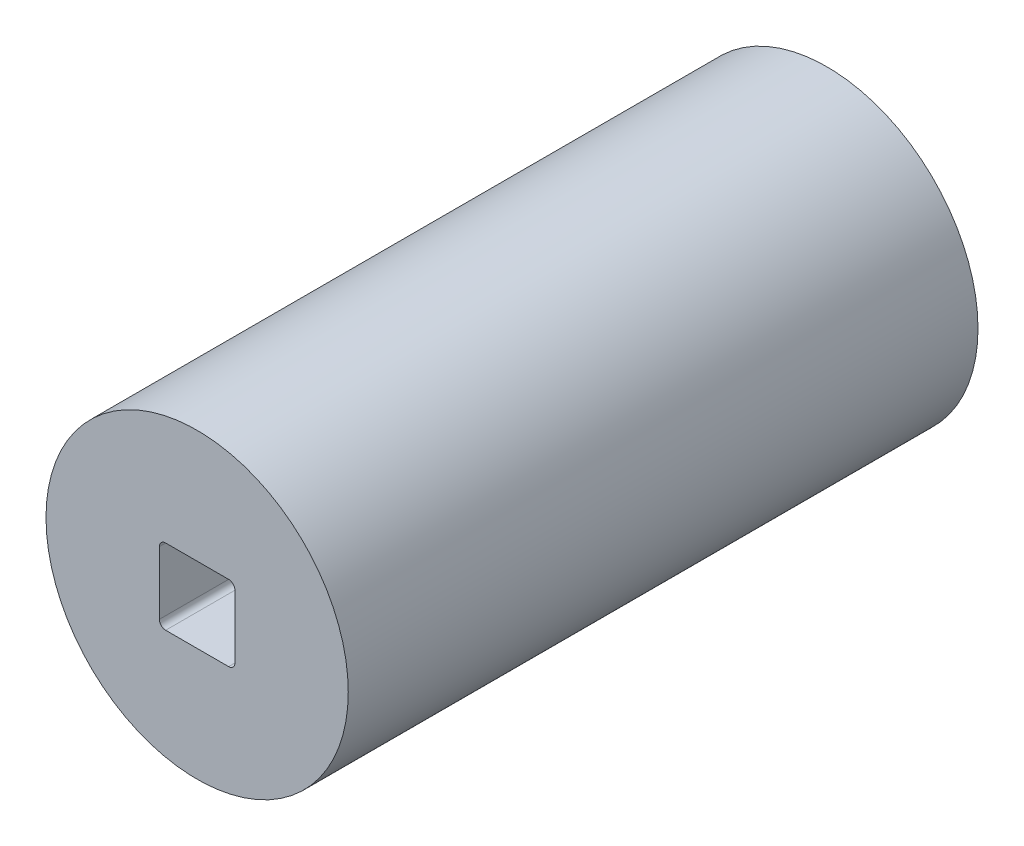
ISO-10303-21;
HEADER;
FILE_DESCRIPTION(('STEP AP214'),'2;1');
FILE_NAME('part.step','',(''),(''),'','','');
FILE_SCHEMA(('AUTOMOTIVE_DESIGN { 1 0 10303 214 1 1 1 1 }'));
ENDSEC;
DATA;
#1=APPLICATION_CONTEXT('core data for automotive mechanical design processes');
#2=APPLICATION_PROTOCOL_DEFINITION('international standard','automotive_design',2000,#1);
#3=PRODUCT_CONTEXT('',#1,'mechanical');
#4=PRODUCT('Part','Part','',(#3));
#5=PRODUCT_RELATED_PRODUCT_CATEGORY('part','',(#4));
#6=PRODUCT_DEFINITION_FORMATION('','',#4);
#7=PRODUCT_DEFINITION_CONTEXT('part definition',#1,'design');
#8=PRODUCT_DEFINITION('design','',#6,#7);
#9=PRODUCT_DEFINITION_SHAPE('','',#8);
#10=(LENGTH_UNIT() NAMED_UNIT(*) SI_UNIT(.MILLI.,.METRE.));
#11=(NAMED_UNIT(*) PLANE_ANGLE_UNIT() SI_UNIT($,.RADIAN.));
#12=(NAMED_UNIT(*) SI_UNIT($,.STERADIAN.) SOLID_ANGLE_UNIT());
#13=UNCERTAINTY_MEASURE_WITH_UNIT(LENGTH_MEASURE(1.E-05),#10,'distance_accuracy_value','');
#14=(GEOMETRIC_REPRESENTATION_CONTEXT(3) GLOBAL_UNCERTAINTY_ASSIGNED_CONTEXT((#13)) GLOBAL_UNIT_ASSIGNED_CONTEXT((#10,
#11,#12)) REPRESENTATION_CONTEXT('',''));
#15=CARTESIAN_POINT('',(0.,0.,0.));
#16=DIRECTION('',(0.,0.,1.));
#17=DIRECTION('',(1.,0.,0.));
#18=AXIS2_PLACEMENT_3D('',#15,#16,#17);
#19=CARTESIAN_POINT('',(0.,0.,-1270.));
#20=DIRECTION('',(0.,0.,1.));
#21=DIRECTION('',(1.,0.,0.));
#22=AXIS2_PLACEMENT_3D('',#19,#20,#21);
#23=CYLINDRICAL_SURFACE('',#22,304.8);
#24=CARTESIAN_POINT('',(0.,0.,-1270.));
#25=DIRECTION('',(0.,0.,1.));
#26=DIRECTION('',(1.,0.,0.));
#27=AXIS2_PLACEMENT_3D('',#24,#25,#26);
#28=CIRCLE('',#27,304.8);
#29=CARTESIAN_POINT('',(304.8,0.,-1270.));
#30=VERTEX_POINT('',#29);
#31=EDGE_CURVE('E55',#30,#30,#28,.T.);
#32=CARTESIAN_POINT('',(0.,0.,0.));
#33=DIRECTION('',(0.,0.,1.));
#34=DIRECTION('',(1.,0.,0.));
#35=AXIS2_PLACEMENT_3D('',#32,#33,#34);
#36=CIRCLE('',#35,304.8);
#37=CARTESIAN_POINT('',(304.8,0.,0.));
#38=VERTEX_POINT('',#37);
#39=EDGE_CURVE('E243',#38,#38,#36,.T.);
#40=CARTESIAN_POINT('',(304.8,0.,-1270.));
#41=CARTESIAN_POINT('',(304.8,0.,-1256.77083333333));
#42=CARTESIAN_POINT('',(304.8,0.,-1243.54166666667));
#43=CARTESIAN_POINT('',(304.8,0.,-1217.08333333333));
#44=CARTESIAN_POINT('',(304.8,0.,-1203.85416666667));
#45=CARTESIAN_POINT('',(304.8,0.,-1177.39583333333));
#46=CARTESIAN_POINT('',(304.8,0.,-1164.16666666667));
#47=CARTESIAN_POINT('',(304.8,0.,-1137.70833333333));
#48=CARTESIAN_POINT('',(304.8,0.,-1124.47916666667));
#49=CARTESIAN_POINT('',(304.8,0.,-1098.02083333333));
#50=CARTESIAN_POINT('',(304.8,0.,-1084.79166666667));
#51=CARTESIAN_POINT('',(304.8,0.,-1058.33333333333));
#52=CARTESIAN_POINT('',(304.8,0.,-1045.10416666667));
#53=CARTESIAN_POINT('',(304.8,0.,-1018.64583333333));
#54=CARTESIAN_POINT('',(304.8,0.,-1005.41666666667));
#55=CARTESIAN_POINT('',(304.8,0.,-978.958333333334));
#56=CARTESIAN_POINT('',(304.8,0.,-965.729166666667));
#57=CARTESIAN_POINT('',(304.8,0.,-939.270833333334));
#58=CARTESIAN_POINT('',(304.8,0.,-926.041666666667));
#59=CARTESIAN_POINT('',(304.8,0.,-899.583333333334));
#60=CARTESIAN_POINT('',(304.8,0.,-886.354166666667));
#61=CARTESIAN_POINT('',(304.8,0.,-859.895833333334));
#62=CARTESIAN_POINT('',(304.8,0.,-846.666666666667));
#63=CARTESIAN_POINT('',(304.8,0.,-820.208333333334));
#64=CARTESIAN_POINT('',(304.8,0.,-806.979166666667));
#65=CARTESIAN_POINT('',(304.8,0.,-780.520833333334));
#66=CARTESIAN_POINT('',(304.8,0.,-767.291666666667));
#67=CARTESIAN_POINT('',(304.8,0.,-740.833333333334));
#68=CARTESIAN_POINT('',(304.8,0.,-727.604166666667));
#69=CARTESIAN_POINT('',(304.8,0.,-701.145833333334));
#70=CARTESIAN_POINT('',(304.8,0.,-687.916666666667));
#71=CARTESIAN_POINT('',(304.8,0.,-661.458333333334));
#72=CARTESIAN_POINT('',(304.8,0.,-648.229166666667));
#73=CARTESIAN_POINT('',(304.8,0.,-621.770833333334));
#74=CARTESIAN_POINT('',(304.8,0.,-608.541666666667));
#75=CARTESIAN_POINT('',(304.8,0.,-582.083333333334));
#76=CARTESIAN_POINT('',(304.8,0.,-568.854166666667));
#77=CARTESIAN_POINT('',(304.8,0.,-542.395833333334));
#78=CARTESIAN_POINT('',(304.8,0.,-529.166666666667));
#79=CARTESIAN_POINT('',(304.8,0.,-502.708333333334));
#80=CARTESIAN_POINT('',(304.8,0.,-489.479166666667));
#81=CARTESIAN_POINT('',(304.8,0.,-463.020833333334));
#82=CARTESIAN_POINT('',(304.8,0.,-449.791666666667));
#83=CARTESIAN_POINT('',(304.8,0.,-423.333333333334));
#84=CARTESIAN_POINT('',(304.8,0.,-410.104166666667));
#85=CARTESIAN_POINT('',(304.8,0.,-383.645833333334));
#86=CARTESIAN_POINT('',(304.8,0.,-370.416666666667));
#87=CARTESIAN_POINT('',(304.8,0.,-343.958333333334));
#88=CARTESIAN_POINT('',(304.8,0.,-330.729166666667));
#89=CARTESIAN_POINT('',(304.8,0.,-304.270833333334));
#90=CARTESIAN_POINT('',(304.8,0.,-291.041666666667));
#91=CARTESIAN_POINT('',(304.8,0.,-264.583333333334));
#92=CARTESIAN_POINT('',(304.8,0.,-251.354166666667));
#93=CARTESIAN_POINT('',(304.8,0.,-224.895833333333));
#94=CARTESIAN_POINT('',(304.8,0.,-211.666666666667));
#95=CARTESIAN_POINT('',(304.8,0.,-185.208333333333));
#96=CARTESIAN_POINT('',(304.8,0.,-171.979166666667));
#97=CARTESIAN_POINT('',(304.8,0.,-145.520833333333));
#98=CARTESIAN_POINT('',(304.8,0.,-132.291666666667));
#99=CARTESIAN_POINT('',(304.8,0.,-105.833333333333));
#100=CARTESIAN_POINT('',(304.8,0.,-92.6041666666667));
#101=CARTESIAN_POINT('',(304.8,0.,-66.1458333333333));
#102=CARTESIAN_POINT('',(304.8,0.,-52.9166666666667));
#103=CARTESIAN_POINT('',(304.8,0.,-26.4583333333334));
#104=CARTESIAN_POINT('',(304.8,0.,-13.2291666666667));
#105=CARTESIAN_POINT('',(304.8,0.,0.));
#106=B_SPLINE_CURVE_WITH_KNOTS('',3,(#40,#41,#42,#43,#44,#45,#46,#47,#48,#49,#50,#51,#52,#53,
#54,#55,#56,#57,#58,#59,#60,#61,#62,#63,#64,#65,#66,#67,#68,#69,#70,#71,#72,#73,#74,#75,#76,#77,
#78,#79,#80,#81,#82,#83,#84,#85,#86,#87,#88,#89,#90,#91,#92,#93,#94,#95,#96,#97,#98,#99,#100,
#101,#102,#103,#104,#105),.UNSPECIFIED.,.F.,.F.,(4,2,2,2,2,2,2,2,2,2,2,2,2,2,2,2,2,2,2,2,2,2,2,
2,2,2,2,2,2,2,2,2,4),(0.,39.6874999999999,79.375,119.0625,158.75,198.4375,238.125,277.8125,
317.5,357.1875,396.875,436.5625,476.25,515.9375,555.625,595.3125,635.,674.6875,714.375,754.0625,
793.75,833.4375,873.125,912.8125,952.5,992.1875,1031.875,1071.5625,1111.25,1150.9375,1190.625,
1230.3125,1270.),.UNSPECIFIED.);
#107=EDGE_CURVE('BSEAM47',#30,#38,#106,.T.);
#108=ORIENTED_EDGE('',*,*,#31,.T.);
#109=ORIENTED_EDGE('',*,*,#39,.F.);
#110=ORIENTED_EDGE('',*,*,#107,.T.);
#111=ORIENTED_EDGE('',*,*,#107,.F.);
#112=EDGE_LOOP('',(#108,#110,#109,#111));
#113=FACE_BOUND('',#112,.T.);
#114=ADVANCED_FACE('F47',(#113),#23,.T.);
#115=CARTESIAN_POINT('',(0.,0.,-1270.));
#116=DIRECTION('',(0.,0.,1.));
#117=DIRECTION('',(1.,0.,0.));
#118=AXIS2_PLACEMENT_3D('',#115,#116,#117);
#119=PLANE('',#118);
#120=ORIENTED_EDGE('',*,*,#31,.F.);
#121=EDGE_LOOP('',(#120));
#122=FACE_BOUND('',#121,.T.);
#123=ADVANCED_FACE('F274',(#122),#119,.F.);
#124=CARTESIAN_POINT('',(0.,0.,0.));
#125=DIRECTION('',(0.,0.,1.));
#126=DIRECTION('',(1.,0.,0.));
#127=AXIS2_PLACEMENT_3D('',#124,#125,#126);
#128=PLANE('',#127);
#129=CARTESIAN_POINT('',(-63.5000000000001,63.4999999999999,0.));
#130=DIRECTION('',(0.,0.,1.));
#131=DIRECTION('',(1.,0.,0.));
#132=AXIS2_PLACEMENT_3D('',#129,#130,#131);
#133=CIRCLE('',#132,12.7);
#134=CARTESIAN_POINT('',(-63.5000000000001,76.2000000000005,0.));
#135=VERTEX_POINT('',#134);
#136=CARTESIAN_POINT('',(-76.2,63.5000000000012,3.77475828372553E-12));
#137=VERTEX_POINT('',#136);
#138=EDGE_CURVE('E210',#135,#137,#133,.T.);
#139=ORIENTED_EDGE('',*,*,#138,.F.);
#140=DIRECTION('',(-1.,0.,0.));
#141=VECTOR('',#140,1.);
#142=CARTESIAN_POINT('',(-63.5000000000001,76.2000000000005,0.));
#143=LINE('',#142,#141);
#144=CARTESIAN_POINT('',(63.5000000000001,76.2,0.));
#145=VERTEX_POINT('',#144);
#146=EDGE_CURVE('E236',#145,#135,#143,.T.);
#147=ORIENTED_EDGE('',*,*,#146,.F.);
#148=CARTESIAN_POINT('',(63.5000000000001,63.5000000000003,0.));
#149=DIRECTION('',(0.,0.,1.));
#150=DIRECTION('',(1.,0.,0.));
#151=AXIS2_PLACEMENT_3D('',#148,#149,#150);
#152=CIRCLE('',#151,12.7);
#153=CARTESIAN_POINT('',(76.1999999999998,63.4999999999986,0.));
#154=VERTEX_POINT('',#153);
#155=EDGE_CURVE('E232',#154,#145,#152,.T.);
#156=ORIENTED_EDGE('',*,*,#155,.F.);
#157=DIRECTION('',(0.,1.,0.));
#158=VECTOR('',#157,1.);
#159=CARTESIAN_POINT('',(76.1999999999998,-63.5000000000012,0.));
#160=LINE('',#159,#158);
#161=CARTESIAN_POINT('',(76.1999999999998,-63.5000000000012,0.));
#162=VERTEX_POINT('',#161);
#163=EDGE_CURVE('E228',#162,#154,#160,.T.);
#164=ORIENTED_EDGE('',*,*,#163,.F.);
#165=CARTESIAN_POINT('',(63.5000000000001,-63.4999999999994,0.));
#166=DIRECTION('',(0.,0.,1.));
#167=DIRECTION('',(1.,0.,0.));
#168=AXIS2_PLACEMENT_3D('',#165,#166,#167);
#169=CIRCLE('',#168,12.7);
#170=CARTESIAN_POINT('',(63.5000000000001,-76.2,0.));
#171=VERTEX_POINT('',#170);
#172=EDGE_CURVE('E224',#171,#162,#169,.T.);
#173=ORIENTED_EDGE('',*,*,#172,.F.);
#174=DIRECTION('',(1.,0.,0.));
#175=VECTOR('',#174,1.);
#176=CARTESIAN_POINT('',(63.5000000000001,-76.2,0.));
#177=LINE('',#176,#175);
#178=CARTESIAN_POINT('',(-63.5000000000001,-76.1999999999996,0.));
#179=VERTEX_POINT('',#178);
#180=EDGE_CURVE('E220',#179,#171,#177,.T.);
#181=ORIENTED_EDGE('',*,*,#180,.F.);
#182=CARTESIAN_POINT('',(-63.5000000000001,-63.4999999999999,0.));
#183=DIRECTION('',(0.,0.,1.));
#184=DIRECTION('',(1.,0.,0.));
#185=AXIS2_PLACEMENT_3D('',#182,#183,#184);
#186=CIRCLE('',#185,12.7);
#187=CARTESIAN_POINT('',(-76.2,-63.4999999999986,3.77475828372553E-12));
#188=VERTEX_POINT('',#187);
#189=EDGE_CURVE('E216',#188,#179,#186,.T.);
#190=ORIENTED_EDGE('',*,*,#189,.F.);
#191=DIRECTION('',(0.,-1.,0.));
#192=VECTOR('',#191,1.);
#193=CARTESIAN_POINT('',(-76.2,63.5000000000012,3.77475828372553E-12));
#194=LINE('',#193,#192);
#195=EDGE_CURVE('E213',#137,#188,#194,.T.);
#196=ORIENTED_EDGE('',*,*,#195,.F.);
#197=EDGE_LOOP('',(#139,#147,#156,#164,#173,#181,#190,#196));
#198=FACE_BOUND('',#197,.T.);
#199=ORIENTED_EDGE('',*,*,#39,.T.);
#200=EDGE_LOOP('',(#199));
#201=FACE_BOUND('',#200,.T.);
#202=ADVANCED_FACE('F271',(#198,#201),#128,.T.);
#203=CARTESIAN_POINT('',(-63.500000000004,63.4999999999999,-1228.725));
#204=DIRECTION('',(0.,0.,1.));
#205=DIRECTION('',(1.,0.,0.));
#206=AXIS2_PLACEMENT_3D('',#203,#204,#205);
#207=CYLINDRICAL_SURFACE('',#206,12.7);
#208=DIRECTION('',(0.,0.,1.));
#209=VECTOR('',#208,1.);
#210=CARTESIAN_POINT('',(-76.2000000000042,63.5000000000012,-1228.725));
#211=LINE('',#210,#209);
#212=CARTESIAN_POINT('',(-76.2000000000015,63.5000000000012,-1209.675));
#213=VERTEX_POINT('',#212);
#214=EDGE_CURVE('E68',#213,#137,#211,.T.);
#215=ORIENTED_EDGE('',*,*,#214,.F.);
#216=CARTESIAN_POINT('',(-63.5000000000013,63.4999999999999,-1209.675));
#217=DIRECTION('',(0.,0.,1.));
#218=DIRECTION('',(1.,0.,0.));
#219=AXIS2_PLACEMENT_3D('',#216,#217,#218);
#220=CIRCLE('',#219,12.7);
#221=CARTESIAN_POINT('',(-63.5000000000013,76.2000000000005,-1209.675));
#222=VERTEX_POINT('',#221);
#223=EDGE_CURVE('E62',#213,#222,#220,.F.);
#224=ORIENTED_EDGE('',*,*,#223,.T.);
#225=DIRECTION('',(0.,0.,1.));
#226=VECTOR('',#225,1.);
#227=CARTESIAN_POINT('',(-63.500000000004,76.2000000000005,-1228.725));
#228=LINE('',#227,#226);
#229=EDGE_CURVE('E240',#222,#135,#228,.T.);
#230=ORIENTED_EDGE('',*,*,#229,.T.);
#231=ORIENTED_EDGE('',*,*,#138,.T.);
#232=EDGE_LOOP('',(#215,#224,#230,#231));
#233=FACE_BOUND('',#232,.T.);
#234=ADVANCED_FACE('F285',(#233),#207,.F.);
#235=CARTESIAN_POINT('',(-63.500000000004,76.2000000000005,-1228.725));
#236=DIRECTION('',(0.,1.,0.));
#237=DIRECTION('',(0.,0.,1.));
#238=AXIS2_PLACEMENT_3D('',#235,#236,#237);
#239=PLANE('',#238);
#240=ORIENTED_EDGE('',*,*,#229,.F.);
#241=DIRECTION('',(1.,0.,0.));
#242=VECTOR('',#241,1.);
#243=CARTESIAN_POINT('',(-63.5000000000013,76.2000000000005,-1209.675));
#244=LINE('',#243,#242);
#245=CARTESIAN_POINT('',(63.4999999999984,76.2,-1209.675));
#246=VERTEX_POINT('',#245);
#247=EDGE_CURVE('E204',#222,#246,#244,.T.);
#248=ORIENTED_EDGE('',*,*,#247,.T.);
#249=DIRECTION('',(0.,0.,1.));
#250=VECTOR('',#249,1.);
#251=CARTESIAN_POINT('',(63.4999999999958,76.2,-1228.725));
#252=LINE('',#251,#250);
#253=EDGE_CURVE('E244',#246,#145,#252,.T.);
#254=ORIENTED_EDGE('',*,*,#253,.T.);
#255=ORIENTED_EDGE('',*,*,#146,.T.);
#256=EDGE_LOOP('',(#240,#248,#254,#255));
#257=FACE_BOUND('',#256,.T.);
#258=ADVANCED_FACE('F290',(#257),#239,.F.);
#259=CARTESIAN_POINT('',(63.4999999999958,63.5000000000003,-1228.725));
#260=DIRECTION('',(0.,0.,1.));
#261=DIRECTION('',(1.,0.,0.));
#262=AXIS2_PLACEMENT_3D('',#259,#260,#261);
#263=CYLINDRICAL_SURFACE('',#262,12.7);
#264=ORIENTED_EDGE('',*,*,#253,.F.);
#265=CARTESIAN_POINT('',(63.4999999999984,63.5000000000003,-1209.675));
#266=DIRECTION('',(0.,0.,1.));
#267=DIRECTION('',(1.,0.,0.));
#268=AXIS2_PLACEMENT_3D('',#265,#266,#267);
#269=CIRCLE('',#268,12.7);
#270=CARTESIAN_POINT('',(76.1999999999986,63.4999999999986,-1209.675));
#271=VERTEX_POINT('',#270);
#272=EDGE_CURVE('E200',#246,#271,#269,.F.);
#273=ORIENTED_EDGE('',*,*,#272,.T.);
#274=DIRECTION('',(0.,0.,1.));
#275=VECTOR('',#274,1.);
#276=CARTESIAN_POINT('',(76.1999999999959,63.4999999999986,-1228.725));
#277=LINE('',#276,#275);
#278=EDGE_CURVE('E247',#271,#154,#277,.T.);
#279=ORIENTED_EDGE('',*,*,#278,.T.);
#280=ORIENTED_EDGE('',*,*,#155,.T.);
#281=EDGE_LOOP('',(#264,#273,#279,#280));
#282=FACE_BOUND('',#281,.T.);
#283=ADVANCED_FACE('F310',(#282),#263,.F.);
#284=CARTESIAN_POINT('',(76.1999999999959,-63.5000000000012,-1228.725));
#285=DIRECTION('',(1.,0.,0.));
#286=DIRECTION('',(0.,0.,-1.));
#287=AXIS2_PLACEMENT_3D('',#284,#285,#286);
#288=PLANE('',#287);
#289=ORIENTED_EDGE('',*,*,#278,.F.);
#290=DIRECTION('',(0.,-1.,0.));
#291=VECTOR('',#290,1.);
#292=CARTESIAN_POINT('',(76.1999999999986,-63.5000000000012,-1209.675));
#293=LINE('',#292,#291);
#294=CARTESIAN_POINT('',(76.1999999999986,-63.5000000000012,-1209.675));
#295=VERTEX_POINT('',#294);
#296=EDGE_CURVE('E196',#271,#295,#293,.T.);
#297=ORIENTED_EDGE('',*,*,#296,.T.);
#298=DIRECTION('',(0.,0.,1.));
#299=VECTOR('',#298,1.);
#300=CARTESIAN_POINT('',(76.1999999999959,-63.5000000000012,-1228.725));
#301=LINE('',#300,#299);
#302=EDGE_CURVE('E250',#295,#162,#301,.T.);
#303=ORIENTED_EDGE('',*,*,#302,.T.);
#304=ORIENTED_EDGE('',*,*,#163,.T.);
#305=EDGE_LOOP('',(#289,#297,#303,#304));
#306=FACE_BOUND('',#305,.T.);
#307=ADVANCED_FACE('F306',(#306),#288,.F.);
#308=CARTESIAN_POINT('',(63.4999999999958,-63.4999999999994,-1228.725));
#309=DIRECTION('',(0.,0.,1.));
#310=DIRECTION('',(1.,0.,0.));
#311=AXIS2_PLACEMENT_3D('',#308,#309,#310);
#312=CYLINDRICAL_SURFACE('',#311,12.7);
#313=ORIENTED_EDGE('',*,*,#302,.F.);
#314=CARTESIAN_POINT('',(63.4999999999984,-63.4999999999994,-1209.675));
#315=DIRECTION('',(0.,0.,1.));
#316=DIRECTION('',(1.,0.,0.));
#317=AXIS2_PLACEMENT_3D('',#314,#315,#316);
#318=CIRCLE('',#317,12.7);
#319=CARTESIAN_POINT('',(63.4999999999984,-76.2,-1209.675));
#320=VERTEX_POINT('',#319);
#321=EDGE_CURVE('E192',#295,#320,#318,.F.);
#322=ORIENTED_EDGE('',*,*,#321,.T.);
#323=DIRECTION('',(0.,0.,1.));
#324=VECTOR('',#323,1.);
#325=CARTESIAN_POINT('',(63.4999999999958,-76.2,-1228.725));
#326=LINE('',#325,#324);
#327=EDGE_CURVE('E253',#320,#171,#326,.T.);
#328=ORIENTED_EDGE('',*,*,#327,.T.);
#329=ORIENTED_EDGE('',*,*,#172,.T.);
#330=EDGE_LOOP('',(#313,#322,#328,#329));
#331=FACE_BOUND('',#330,.T.);
#332=ADVANCED_FACE('F302',(#331),#312,.F.);
#333=CARTESIAN_POINT('',(63.4999999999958,-76.2,-1228.725));
#334=DIRECTION('',(0.,-1.,0.));
#335=DIRECTION('',(0.,0.,-1.));
#336=AXIS2_PLACEMENT_3D('',#333,#334,#335);
#337=PLANE('',#336);
#338=ORIENTED_EDGE('',*,*,#327,.F.);
#339=DIRECTION('',(-1.,0.,0.));
#340=VECTOR('',#339,1.);
#341=CARTESIAN_POINT('',(63.4999999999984,-76.2,-1209.675));
#342=LINE('',#341,#340);
#343=CARTESIAN_POINT('',(-63.5000000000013,-76.1999999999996,-1209.675));
#344=VERTEX_POINT('',#343);
#345=EDGE_CURVE('E183',#320,#344,#342,.T.);
#346=ORIENTED_EDGE('',*,*,#345,.T.);
#347=DIRECTION('',(0.,0.,1.));
#348=VECTOR('',#347,1.);
#349=CARTESIAN_POINT('',(-63.500000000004,-76.1999999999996,-1228.725));
#350=LINE('',#349,#348);
#351=EDGE_CURVE('E256',#344,#179,#350,.T.);
#352=ORIENTED_EDGE('',*,*,#351,.T.);
#353=ORIENTED_EDGE('',*,*,#180,.T.);
#354=EDGE_LOOP('',(#338,#346,#352,#353));
#355=FACE_BOUND('',#354,.T.);
#356=ADVANCED_FACE('F298',(#355),#337,.F.);
#357=CARTESIAN_POINT('',(-63.500000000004,-63.4999999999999,-1228.725));
#358=DIRECTION('',(0.,0.,1.));
#359=DIRECTION('',(1.,0.,0.));
#360=AXIS2_PLACEMENT_3D('',#357,#358,#359);
#361=CYLINDRICAL_SURFACE('',#360,12.7);
#362=ORIENTED_EDGE('',*,*,#351,.F.);
#363=CARTESIAN_POINT('',(-63.5000000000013,-63.4999999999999,-1209.675));
#364=DIRECTION('',(0.,0.,1.));
#365=DIRECTION('',(1.,0.,0.));
#366=AXIS2_PLACEMENT_3D('',#363,#364,#365);
#367=CIRCLE('',#366,12.7);
#368=CARTESIAN_POINT('',(-76.2000000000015,-63.4999999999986,-1209.675));
#369=VERTEX_POINT('',#368);
#370=EDGE_CURVE('E176',#344,#369,#367,.F.);
#371=ORIENTED_EDGE('',*,*,#370,.T.);
#372=DIRECTION('',(0.,0.,1.));
#373=VECTOR('',#372,1.);
#374=CARTESIAN_POINT('',(-76.2000000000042,-63.4999999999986,-1228.725));
#375=LINE('',#374,#373);
#376=EDGE_CURVE('E259',#369,#188,#375,.T.);
#377=ORIENTED_EDGE('',*,*,#376,.T.);
#378=ORIENTED_EDGE('',*,*,#189,.T.);
#379=EDGE_LOOP('',(#362,#371,#377,#378));
#380=FACE_BOUND('',#379,.T.);
#381=ADVANCED_FACE('F295',(#380),#361,.F.);
#382=CARTESIAN_POINT('',(-76.2000000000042,63.5000000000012,-1228.725));
#383=DIRECTION('',(-1.,0.,0.));
#384=DIRECTION('',(0.,-1.,0.));
#385=AXIS2_PLACEMENT_3D('',#382,#383,#384);
#386=PLANE('',#385);
#387=ORIENTED_EDGE('',*,*,#376,.F.);
#388=DIRECTION('',(0.,1.,0.));
#389=VECTOR('',#388,1.);
#390=CARTESIAN_POINT('',(-76.2000000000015,63.5000000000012,-1209.675));
#391=LINE('',#390,#389);
#392=EDGE_CURVE('E11',#369,#213,#391,.T.);
#393=ORIENTED_EDGE('',*,*,#392,.T.);
#394=ORIENTED_EDGE('',*,*,#214,.T.);
#395=ORIENTED_EDGE('',*,*,#195,.T.);
#396=EDGE_LOOP('',(#387,#393,#394,#395));
#397=FACE_BOUND('',#396,.T.);
#398=ADVANCED_FACE('F292',(#397),#386,.F.);
#399=CARTESIAN_POINT('',(-1.4432899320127E-12,0.,-1209.675));
#400=DIRECTION('',(0.,0.,1.));
#401=DIRECTION('',(1.,0.,0.));
#402=AXIS2_PLACEMENT_3D('',#399,#400,#401);
#403=PLANE('',#402);
#404=DIRECTION('',(0.,-1.,0.));
#405=VECTOR('',#404,1.);
#406=CARTESIAN_POINT('',(-228.600000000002,131.98227153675,-1209.675));
#407=LINE('',#406,#405);
#408=CARTESIAN_POINT('',(-228.600000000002,131.98227153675,-1209.675));
#409=VERTEX_POINT('',#408);
#410=CARTESIAN_POINT('',(-228.600000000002,-131.982271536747,-1209.675));
#411=VERTEX_POINT('',#410);
#412=EDGE_CURVE('E152',#409,#411,#407,.T.);
#413=ORIENTED_EDGE('',*,*,#412,.F.);
#414=DIRECTION('',(-0.866025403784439,-0.5,0.));
#415=VECTOR('',#414,1.);
#416=CARTESIAN_POINT('',(-1.4432899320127E-12,263.964543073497,-1209.675));
#417=LINE('',#416,#415);
#418=CARTESIAN_POINT('',(-1.4432899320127E-12,263.964543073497,-1209.675));
#419=VERTEX_POINT('',#418);
#420=EDGE_CURVE('E471',#419,#409,#417,.T.);
#421=ORIENTED_EDGE('',*,*,#420,.F.);
#422=DIRECTION('',(-0.866025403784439,0.5,0.));
#423=VECTOR('',#422,1.);
#424=CARTESIAN_POINT('',(228.6,131.982271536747,-1209.675));
#425=LINE('',#424,#423);
#426=CARTESIAN_POINT('',(228.6,131.982271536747,-1209.675));
#427=VERTEX_POINT('',#426);
#428=EDGE_CURVE('E498',#427,#419,#425,.T.);
#429=ORIENTED_EDGE('',*,*,#428,.F.);
#430=DIRECTION('',(0.,1.,0.));
#431=VECTOR('',#430,1.);
#432=CARTESIAN_POINT('',(228.599999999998,-131.98227153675,-1209.675));
#433=LINE('',#432,#431);
#434=CARTESIAN_POINT('',(228.599999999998,-131.98227153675,-1209.675));
#435=VERTEX_POINT('',#434);
#436=EDGE_CURVE('E501',#435,#427,#433,.T.);
#437=ORIENTED_EDGE('',*,*,#436,.F.);
#438=DIRECTION('',(0.866025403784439,0.5,0.));
#439=VECTOR('',#438,1.);
#440=CARTESIAN_POINT('',(-1.4432899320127E-12,-263.964543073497,-1209.675));
#441=LINE('',#440,#439);
#442=CARTESIAN_POINT('',(-1.4432899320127E-12,-263.964543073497,-1209.675));
#443=VERTEX_POINT('',#442);
#444=EDGE_CURVE('E154',#443,#435,#441,.T.);
#445=ORIENTED_EDGE('',*,*,#444,.F.);
#446=DIRECTION('',(0.866025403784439,-0.5,0.));
#447=VECTOR('',#446,1.);
#448=CARTESIAN_POINT('',(-228.600000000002,-131.982271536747,-1209.675));
#449=LINE('',#448,#447);
#450=EDGE_CURVE('E148',#411,#443,#449,.T.);
#451=ORIENTED_EDGE('',*,*,#450,.F.);
#452=EDGE_LOOP('',(#413,#421,#429,#437,#445,#451));
#453=FACE_BOUND('',#452,.T.);
#454=ORIENTED_EDGE('',*,*,#392,.F.);
#455=ORIENTED_EDGE('',*,*,#370,.F.);
#456=ORIENTED_EDGE('',*,*,#345,.F.);
#457=ORIENTED_EDGE('',*,*,#321,.F.);
#458=ORIENTED_EDGE('',*,*,#296,.F.);
#459=ORIENTED_EDGE('',*,*,#272,.F.);
#460=ORIENTED_EDGE('',*,*,#247,.F.);
#461=ORIENTED_EDGE('',*,*,#223,.F.);
#462=EDGE_LOOP('',(#454,#455,#456,#457,#458,#459,#460,#461));
#463=FACE_BOUND('',#462,.T.);
#464=ADVANCED_FACE('F150',(#453,#463),#403,.F.);
#465=CARTESIAN_POINT('',(-228.600000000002,131.98227153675,-1209.675));
#466=DIRECTION('',(1.,0.,0.));
#467=DIRECTION('',(0.,1.,0.));
#468=AXIS2_PLACEMENT_3D('',#465,#466,#467);
#469=PLANE('',#468);
#470=DIRECTION('',(0.,-1.,0.));
#471=VECTOR('',#470,1.);
#472=CARTESIAN_POINT('',(-228.600000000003,131.98227153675,-1228.725));
#473=LINE('',#472,#471);
#474=CARTESIAN_POINT('',(-228.600000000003,131.98227153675,-1228.725));
#475=VERTEX_POINT('',#474);
#476=CARTESIAN_POINT('',(-228.600000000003,-131.982271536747,-1228.725));
#477=VERTEX_POINT('',#476);
#478=EDGE_CURVE('E493',#475,#477,#473,.T.);
#479=ORIENTED_EDGE('',*,*,#478,.F.);
#480=DIRECTION('',(0.,0.,-1.));
#481=VECTOR('',#480,1.);
#482=CARTESIAN_POINT('',(-228.600000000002,131.98227153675,-1209.675));
#483=LINE('',#482,#481);
#484=EDGE_CURVE('E169',#409,#475,#483,.T.);
#485=ORIENTED_EDGE('',*,*,#484,.F.);
#486=ORIENTED_EDGE('',*,*,#412,.T.);
#487=DIRECTION('',(0.,0.,-1.));
#488=VECTOR('',#487,1.);
#489=CARTESIAN_POINT('',(-228.600000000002,-131.982271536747,-1209.675));
#490=LINE('',#489,#488);
#491=EDGE_CURVE('E166',#411,#477,#490,.T.);
#492=ORIENTED_EDGE('',*,*,#491,.T.);
#493=EDGE_LOOP('',(#479,#485,#486,#492));
#494=FACE_BOUND('',#493,.T.);
#495=ADVANCED_FACE('F165',(#494),#469,.T.);
#496=CARTESIAN_POINT('',(-228.600000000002,-131.982271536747,-1209.675));
#497=DIRECTION('',(0.5,0.866025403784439,0.));
#498=DIRECTION('',(-0.866025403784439,0.5,0.));
#499=AXIS2_PLACEMENT_3D('',#496,#497,#498);
#500=PLANE('',#499);
#501=DIRECTION('',(0.866025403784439,-0.5,0.));
#502=VECTOR('',#501,1.);
#503=CARTESIAN_POINT('',(-228.600000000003,-131.982271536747,-1228.725));
#504=LINE('',#503,#502);
#505=CARTESIAN_POINT('',(-4.10782519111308E-12,-263.964543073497,-1228.725));
#506=VERTEX_POINT('',#505);
#507=EDGE_CURVE('E174',#477,#506,#504,.T.);
#508=ORIENTED_EDGE('',*,*,#507,.F.);
#509=ORIENTED_EDGE('',*,*,#491,.F.);
#510=ORIENTED_EDGE('',*,*,#450,.T.);
#511=DIRECTION('',(0.,0.,-1.));
#512=VECTOR('',#511,1.);
#513=CARTESIAN_POINT('',(-1.4432899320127E-12,-263.964543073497,-1209.675));
#514=LINE('',#513,#512);
#515=EDGE_CURVE('E177',#443,#506,#514,.T.);
#516=ORIENTED_EDGE('',*,*,#515,.T.);
#517=EDGE_LOOP('',(#508,#509,#510,#516));
#518=FACE_BOUND('',#517,.T.);
#519=ADVANCED_FACE('F173',(#518),#500,.T.);
#520=CARTESIAN_POINT('',(-1.4432899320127E-12,-263.964543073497,-1209.675));
#521=DIRECTION('',(-0.5,0.866025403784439,0.));
#522=DIRECTION('',(-0.866025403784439,-0.5,0.));
#523=AXIS2_PLACEMENT_3D('',#520,#521,#522);
#524=PLANE('',#523);
#525=DIRECTION('',(0.866025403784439,0.5,0.));
#526=VECTOR('',#525,1.);
#527=CARTESIAN_POINT('',(-4.10782519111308E-12,-263.964543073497,-1228.725));
#528=LINE('',#527,#526);
#529=CARTESIAN_POINT('',(228.599999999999,-131.98227153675,-1228.725));
#530=VERTEX_POINT('',#529);
#531=EDGE_CURVE('E483',#506,#530,#528,.T.);
#532=ORIENTED_EDGE('',*,*,#531,.F.);
#533=ORIENTED_EDGE('',*,*,#515,.F.);
#534=ORIENTED_EDGE('',*,*,#444,.T.);
#535=DIRECTION('',(0.,0.,-1.));
#536=VECTOR('',#535,1.);
#537=CARTESIAN_POINT('',(228.599999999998,-131.98227153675,-1209.675));
#538=LINE('',#537,#536);
#539=EDGE_CURVE('E185',#435,#530,#538,.T.);
#540=ORIENTED_EDGE('',*,*,#539,.T.);
#541=EDGE_LOOP('',(#532,#533,#534,#540));
#542=FACE_BOUND('',#541,.T.);
#543=ADVANCED_FACE('F327',(#542),#524,.T.);
#544=CARTESIAN_POINT('',(228.599999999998,-131.98227153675,-1209.675));
#545=DIRECTION('',(-1.,0.,0.));
#546=DIRECTION('',(0.,0.,1.));
#547=AXIS2_PLACEMENT_3D('',#544,#545,#546);
#548=PLANE('',#547);
#549=DIRECTION('',(0.,1.,0.));
#550=VECTOR('',#549,1.);
#551=CARTESIAN_POINT('',(228.599999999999,-131.98227153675,-1228.725));
#552=LINE('',#551,#550);
#553=CARTESIAN_POINT('',(228.599999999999,131.982271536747,-1228.725));
#554=VERTEX_POINT('',#553);
#555=EDGE_CURVE('E465',#530,#554,#552,.T.);
#556=ORIENTED_EDGE('',*,*,#555,.F.);
#557=ORIENTED_EDGE('',*,*,#539,.F.);
#558=ORIENTED_EDGE('',*,*,#436,.T.);
#559=DIRECTION('',(0.,0.,-1.));
#560=VECTOR('',#559,1.);
#561=CARTESIAN_POINT('',(228.6,131.982271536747,-1209.675));
#562=LINE('',#561,#560);
#563=EDGE_CURVE('E474',#427,#554,#562,.T.);
#564=ORIENTED_EDGE('',*,*,#563,.T.);
#565=EDGE_LOOP('',(#556,#557,#558,#564));
#566=FACE_BOUND('',#565,.T.);
#567=ADVANCED_FACE('F330',(#566),#548,.T.);
#568=CARTESIAN_POINT('',(228.6,131.982271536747,-1209.675));
#569=DIRECTION('',(-0.5,-0.866025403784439,0.));
#570=DIRECTION('',(0.866025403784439,-0.5,0.));
#571=AXIS2_PLACEMENT_3D('',#568,#569,#570);
#572=PLANE('',#571);
#573=DIRECTION('',(-0.866025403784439,0.5,0.));
#574=VECTOR('',#573,1.);
#575=CARTESIAN_POINT('',(228.599999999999,131.982271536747,-1228.725));
#576=LINE('',#575,#574);
#577=CARTESIAN_POINT('',(-4.10782519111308E-12,263.964543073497,-1228.725));
#578=VERTEX_POINT('',#577);
#579=EDGE_CURVE('E461',#554,#578,#576,.T.);
#580=ORIENTED_EDGE('',*,*,#579,.F.);
#581=ORIENTED_EDGE('',*,*,#563,.F.);
#582=ORIENTED_EDGE('',*,*,#428,.T.);
#583=DIRECTION('',(0.,0.,-1.));
#584=VECTOR('',#583,1.);
#585=CARTESIAN_POINT('',(-1.4432899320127E-12,263.964543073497,-1209.675));
#586=LINE('',#585,#584);
#587=EDGE_CURVE('E459',#419,#578,#586,.T.);
#588=ORIENTED_EDGE('',*,*,#587,.T.);
#589=EDGE_LOOP('',(#580,#581,#582,#588));
#590=FACE_BOUND('',#589,.T.);
#591=ADVANCED_FACE('F334',(#590),#572,.T.);
#592=CARTESIAN_POINT('',(-1.4432899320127E-12,263.964543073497,-1209.675));
#593=DIRECTION('',(0.5,-0.866025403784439,0.));
#594=DIRECTION('',(0.866025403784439,0.5,0.));
#595=AXIS2_PLACEMENT_3D('',#592,#593,#594);
#596=PLANE('',#595);
#597=DIRECTION('',(-0.866025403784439,-0.5,0.));
#598=VECTOR('',#597,1.);
#599=CARTESIAN_POINT('',(-4.10782519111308E-12,263.964543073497,-1228.725));
#600=LINE('',#599,#598);
#601=EDGE_CURVE('E171',#578,#475,#600,.T.);
#602=ORIENTED_EDGE('',*,*,#601,.F.);
#603=ORIENTED_EDGE('',*,*,#587,.F.);
#604=ORIENTED_EDGE('',*,*,#420,.T.);
#605=ORIENTED_EDGE('',*,*,#484,.T.);
#606=EDGE_LOOP('',(#602,#603,#604,#605));
#607=FACE_BOUND('',#606,.T.);
#608=ADVANCED_FACE('F321',(#607),#596,.T.);
#609=CARTESIAN_POINT('',(-63.500000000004,63.4999999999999,-1228.725));
#610=DIRECTION('',(0.,0.,1.));
#611=DIRECTION('',(1.,0.,0.));
#612=AXIS2_PLACEMENT_3D('',#609,#610,#611);
#613=PLANE('',#612);
#614=ORIENTED_EDGE('',*,*,#478,.T.);
#615=ORIENTED_EDGE('',*,*,#507,.T.);
#616=ORIENTED_EDGE('',*,*,#531,.T.);
#617=ORIENTED_EDGE('',*,*,#555,.T.);
#618=ORIENTED_EDGE('',*,*,#579,.T.);
#619=ORIENTED_EDGE('',*,*,#601,.T.);
#620=EDGE_LOOP('',(#614,#615,#616,#617,#618,#619));
#621=FACE_BOUND('',#620,.T.);
#622=ADVANCED_FACE('F318',(#621),#613,.T.);
#623=CLOSED_SHELL('',(#114,#123,#202,#234,#258,#283,#307,#332,#356,#381,#398,#464,#495,#519,
#543,#567,#591,#608,#622));
#624=MANIFOLD_SOLID_BREP('B2',#623);
#625=ADVANCED_BREP_SHAPE_REPRESENTATION('',(#18,#624),#14);
#626=SHAPE_DEFINITION_REPRESENTATION(#9,#625);
ENDSEC;
END-ISO-10303-21;
